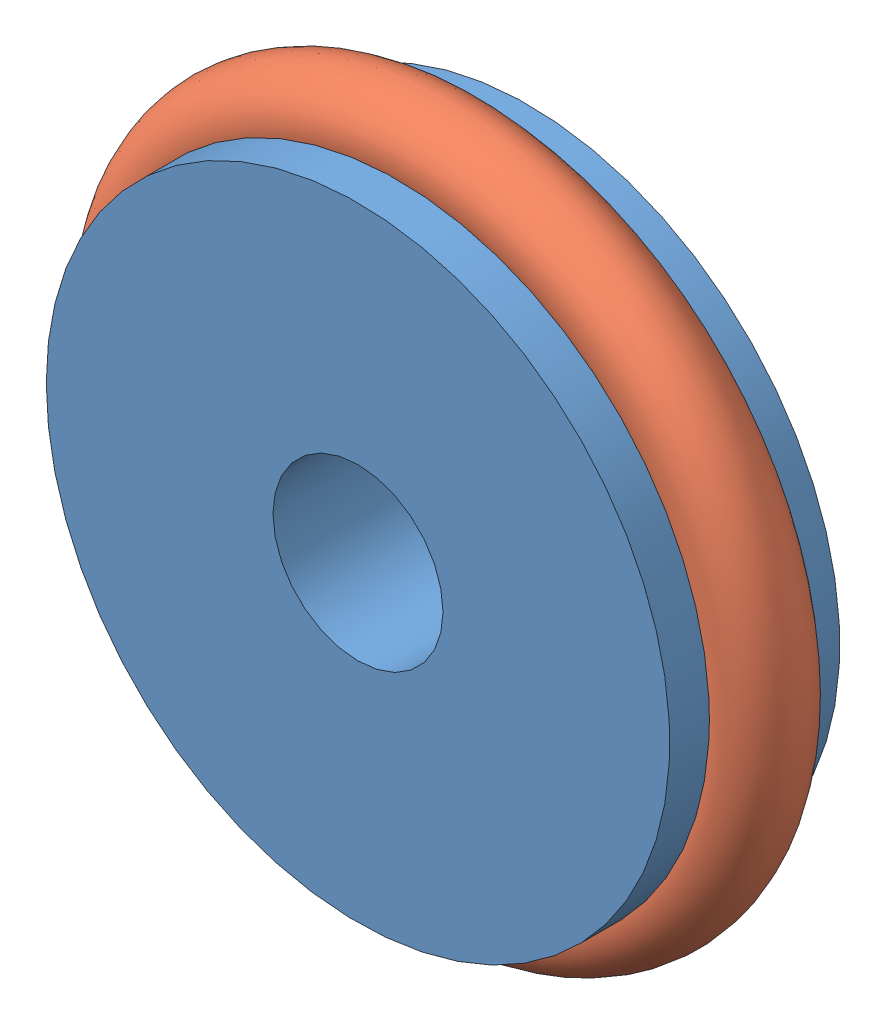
SolidWorks assembly Rodilha Com O Ring.SLDASM, configuration Valor predeterminado (file format 13000). Lengths in mm.
Overall size (17.51 17.51 3).
2 component instances, 2 part files, 2 mates.
Components (placement in the parent):
- Rodilha-1: Rodilha.SLDPRT [Valor predeterminado] at (-1.49 -1.0185 9) size (11 11 3)
- O-Ring 10x7x1,5 mm-1: O-Ring 10x7x1,5 mm.SLDPRT [Valor predeterminado] at (-1.49 -1.0185 8.95) x (0.825133 -0.564938 0) z (0.564938 0.825133 0) size (12.6 1.5 12.6)
Mates (geometry in assembly coordinates):
- Concêntrico1: concentric: cylinder of Rodilha-1 through (-1.49 -1.0185 7.5) axis (0 0 1) radius 1.5; line of O-Ring 10x7x1,5 mm-1 through (-1.49 -1.0185 15.5148) axis (0 0 -1)
- Tangente1: tangent anti-aligned: plane of Rodilha-1 through (3.21 -1.0185 8.2) normal (0 0 1); torus of O-Ring 10x7x1,5 mm-1
